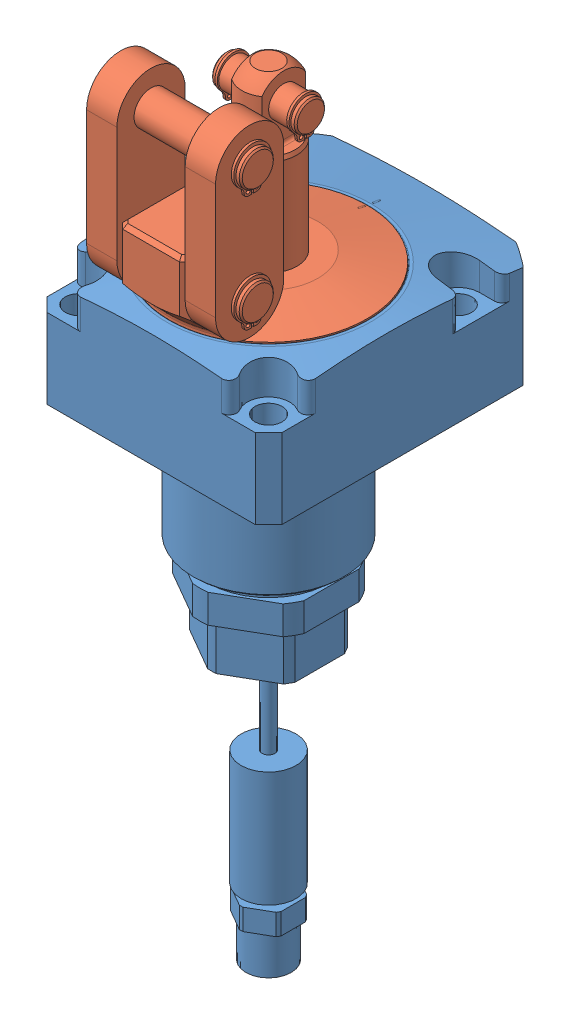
SolidWorks assembly ilc16321800US.SLDASM, configuration Default (file format 13000). Lengths in mm.
Overall size (61.99 210.06 72.53).
2 component instances, 2 part files, 3 mates.
Components (placement in the parent):
- ilc16321800US_BODY-1: ilc16321800US_BODY.SLDPRT [Default] at origin size (61.99 159.11 72.53)
- ilc16321800US_LUG-1: ilc16321800US_LUG.SLDPRT [Default] at (0 21.0058 0) size (51.93 60.5 56.97)
Mates (geometry in assembly coordinates):
- Coincident1: coincident anti-aligned: plane of ilc16321800US_BODY-1 through (26.0096 21.0058 0) normal (0 1 0); plane of ilc16321800_LUG-1 through (-9 21.0058 31) normal (0 -1 0)
- Concentric1: concentric anti-aligned: cylinder of ilc16321800US_BODY-1 through (0 -8.9689 0) axis (0 -1 0) radius 26.0096; cylinder of ilc16321800_LUG-1 through (0 37.6371 0) axis (0 1 0) radius 25.965
- LUG ANGLE: planar angle = 3.141593 rad anti-aligned: plane of ilc16321800_LUG-1 through (0 21.0058 0) normal (1 0 0)
